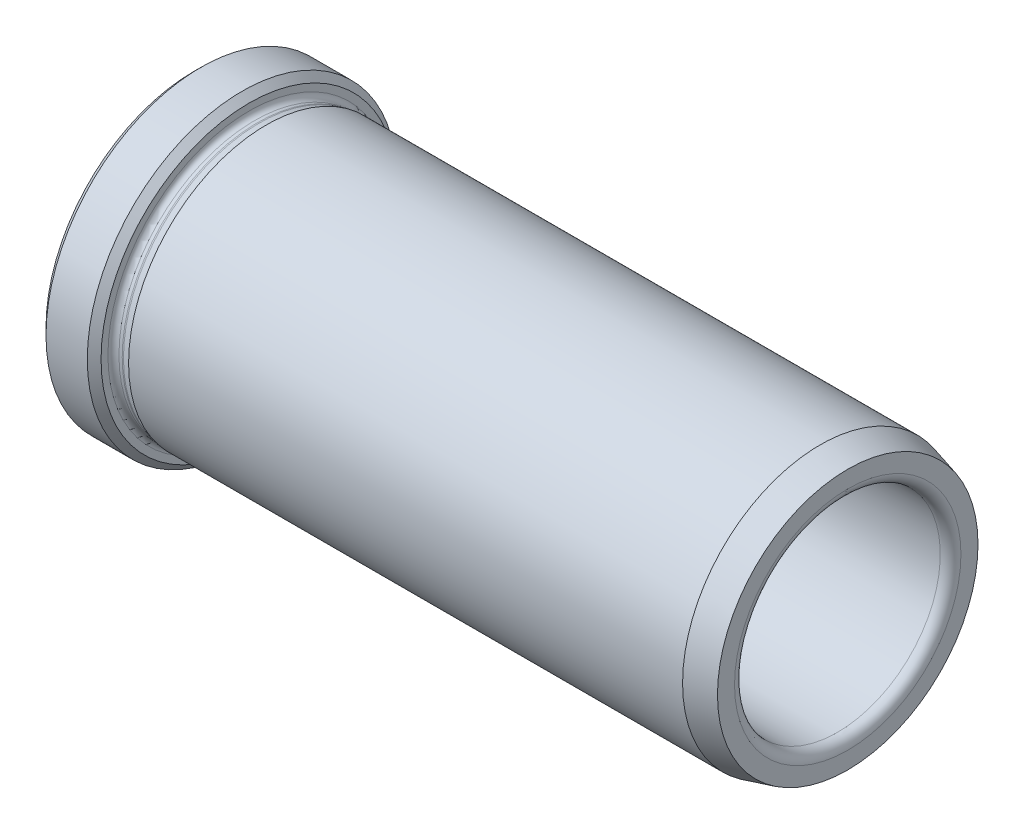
ISO-10303-21;
HEADER;
FILE_DESCRIPTION(('STEP AP214'),'2;1');
FILE_NAME('part.step','',(''),(''),'','','');
FILE_SCHEMA(('AUTOMOTIVE_DESIGN { 1 0 10303 214 1 1 1 1 }'));
ENDSEC;
DATA;
#1=APPLICATION_CONTEXT('core data for automotive mechanical design processes');
#2=APPLICATION_PROTOCOL_DEFINITION('international standard','automotive_design',2000,#1);
#3=PRODUCT_CONTEXT('',#1,'mechanical');
#4=PRODUCT('Part','Part','',(#3));
#5=PRODUCT_RELATED_PRODUCT_CATEGORY('part','',(#4));
#6=PRODUCT_DEFINITION_FORMATION('','',#4);
#7=PRODUCT_DEFINITION_CONTEXT('part definition',#1,'design');
#8=PRODUCT_DEFINITION('design','',#6,#7);
#9=PRODUCT_DEFINITION_SHAPE('','',#8);
#10=(LENGTH_UNIT() NAMED_UNIT(*) SI_UNIT(.MILLI.,.METRE.));
#11=(NAMED_UNIT(*) PLANE_ANGLE_UNIT() SI_UNIT($,.RADIAN.));
#12=(NAMED_UNIT(*) SI_UNIT($,.STERADIAN.) SOLID_ANGLE_UNIT());
#13=UNCERTAINTY_MEASURE_WITH_UNIT(LENGTH_MEASURE(1.E-05),#10,'distance_accuracy_value','');
#14=(GEOMETRIC_REPRESENTATION_CONTEXT(3) GLOBAL_UNCERTAINTY_ASSIGNED_CONTEXT((#13)) GLOBAL_UNIT_ASSIGNED_CONTEXT((#10,
#11,#12)) REPRESENTATION_CONTEXT('',''));
#15=CARTESIAN_POINT('',(0.,0.,0.));
#16=DIRECTION('',(0.,0.,1.));
#17=DIRECTION('',(1.,0.,0.));
#18=AXIS2_PLACEMENT_3D('',#15,#16,#17);
#19=CARTESIAN_POINT('',(30.9097582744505,14.95,0.));
#20=DIRECTION('',(1.,0.,0.));
#21=DIRECTION('',(0.,0.,-1.));
#22=AXIS2_PLACEMENT_3D('',#19,#20,#21);
#23=PLANE('',#22);
#24=CARTESIAN_POINT('',(30.9097582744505,0.,0.));
#25=DIRECTION('',(-1.,0.,0.));
#26=DIRECTION('',(0.,0.,1.));
#27=AXIS2_PLACEMENT_3D('',#24,#25,#26);
#28=CIRCLE('',#27,14.95);
#29=CARTESIAN_POINT('',(30.9097582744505,0.,14.95));
#30=VERTEX_POINT('',#29);
#31=EDGE_CURVE('E46',#30,#30,#28,.T.);
#32=ORIENTED_EDGE('',*,*,#31,.F.);
#33=EDGE_LOOP('',(#32));
#34=FACE_BOUND('',#33,.T.);
#35=CARTESIAN_POINT('',(30.9097582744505,0.,0.));
#36=DIRECTION('',(-1.,0.,0.));
#37=DIRECTION('',(0.,0.,1.));
#38=AXIS2_PLACEMENT_3D('',#35,#36,#37);
#39=CIRCLE('',#38,15.);
#40=CARTESIAN_POINT('',(30.9097582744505,0.,15.));
#41=VERTEX_POINT('',#40);
#42=EDGE_CURVE('E70',#41,#41,#39,.T.);
#43=ORIENTED_EDGE('',*,*,#42,.T.);
#44=EDGE_LOOP('',(#43));
#45=FACE_BOUND('',#44,.T.);
#46=ADVANCED_FACE('F14',(#34,#45),#23,.F.);
#47=CARTESIAN_POINT('',(0.,0.,0.));
#48=DIRECTION('',(-1.,0.,0.));
#49=DIRECTION('',(0.,0.,1.));
#50=AXIS2_PLACEMENT_3D('',#47,#48,#49);
#51=CYLINDRICAL_SURFACE('',#50,14.95);
#52=CARTESIAN_POINT('',(94.4097582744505,0.,0.));
#53=DIRECTION('',(-1.,0.,0.));
#54=DIRECTION('',(0.,0.,1.));
#55=AXIS2_PLACEMENT_3D('',#52,#53,#54);
#56=CIRCLE('',#55,14.95);
#57=CARTESIAN_POINT('',(94.4097582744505,0.,14.95));
#58=VERTEX_POINT('',#57);
#59=EDGE_CURVE('E34',#58,#58,#56,.F.);
#60=ORIENTED_EDGE('',*,*,#59,.T.);
#61=EDGE_LOOP('',(#60));
#62=FACE_BOUND('',#61,.T.);
#63=ORIENTED_EDGE('',*,*,#31,.T.);
#64=EDGE_LOOP('',(#63));
#65=FACE_BOUND('',#64,.T.);
#66=ADVANCED_FACE('F94',(#62,#65),#51,.F.);
#67=CARTESIAN_POINT('',(95.9097582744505,18.9282032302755,0.));
#68=DIRECTION('',(-1.,0.,0.));
#69=DIRECTION('',(0.,0.,1.));
#70=AXIS2_PLACEMENT_3D('',#67,#68,#69);
#71=PLANE('',#70);
#72=CARTESIAN_POINT('',(95.9097582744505,0.,0.));
#73=DIRECTION('',(-1.,0.,0.));
#74=DIRECTION('',(0.,0.,1.));
#75=AXIS2_PLACEMENT_3D('',#72,#73,#74);
#76=CIRCLE('',#75,16.45);
#77=CARTESIAN_POINT('',(95.9097582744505,0.,16.45));
#78=VERTEX_POINT('',#77);
#79=EDGE_CURVE('E37',#78,#78,#76,.T.);
#80=ORIENTED_EDGE('',*,*,#79,.T.);
#81=EDGE_LOOP('',(#80));
#82=FACE_BOUND('',#81,.T.);
#83=CARTESIAN_POINT('',(95.9097582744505,0.,0.));
#84=DIRECTION('',(-1.,0.,0.));
#85=DIRECTION('',(0.,0.,1.));
#86=AXIS2_PLACEMENT_3D('',#83,#84,#85);
#87=CIRCLE('',#86,18.9282032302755);
#88=CARTESIAN_POINT('',(95.9097582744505,0.,18.9282032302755));
#89=VERTEX_POINT('',#88);
#90=EDGE_CURVE('E49',#89,#89,#87,.T.);
#91=ORIENTED_EDGE('',*,*,#90,.F.);
#92=EDGE_LOOP('',(#91));
#93=FACE_BOUND('',#92,.T.);
#94=ADVANCED_FACE('F101',(#82,#93),#71,.F.);
#95=CARTESIAN_POINT('',(95.9097582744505,0.,0.));
#96=DIRECTION('',(-1.,0.,0.));
#97=DIRECTION('',(0.,0.,1.));
#98=AXIS2_PLACEMENT_3D('',#95,#96,#97);
#99=CONICAL_SURFACE('',#98,18.9282032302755,0.26179938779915);
#100=CARTESIAN_POINT('',(91.9097582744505,0.,0.));
#101=DIRECTION('',(-1.,0.,0.));
#102=DIRECTION('',(0.,0.,1.));
#103=AXIS2_PLACEMENT_3D('',#100,#101,#102);
#104=CIRCLE('',#103,20.);
#105=CARTESIAN_POINT('',(91.9097582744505,0.,20.));
#106=VERTEX_POINT('',#105);
#107=EDGE_CURVE('E52',#106,#106,#104,.T.);
#108=ORIENTED_EDGE('',*,*,#107,.F.);
#109=EDGE_LOOP('',(#108));
#110=FACE_BOUND('',#109,.T.);
#111=ORIENTED_EDGE('',*,*,#90,.T.);
#112=EDGE_LOOP('',(#111));
#113=FACE_BOUND('',#112,.T.);
#114=ADVANCED_FACE('F165',(#110,#113),#99,.T.);
#115=CARTESIAN_POINT('',(0.,0.,0.));
#116=DIRECTION('',(-1.,0.,0.));
#117=DIRECTION('',(0.,0.,1.));
#118=AXIS2_PLACEMENT_3D('',#115,#116,#117);
#119=CYLINDRICAL_SURFACE('',#118,20.);
#120=CARTESIAN_POINT('',(11.4097582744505,0.,0.));
#121=DIRECTION('',(-1.,0.,0.));
#122=DIRECTION('',(0.,0.,1.));
#123=AXIS2_PLACEMENT_3D('',#120,#121,#122);
#124=CIRCLE('',#123,20.);
#125=CARTESIAN_POINT('',(11.4097582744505,0.,20.));
#126=VERTEX_POINT('',#125);
#127=EDGE_CURVE('E55',#126,#126,#124,.T.);
#128=ORIENTED_EDGE('',*,*,#127,.F.);
#129=EDGE_LOOP('',(#128));
#130=FACE_BOUND('',#129,.T.);
#131=ORIENTED_EDGE('',*,*,#107,.T.);
#132=EDGE_LOOP('',(#131));
#133=FACE_BOUND('',#132,.T.);
#134=ADVANCED_FACE('F205',(#130,#133),#119,.T.);
#135=CARTESIAN_POINT('',(11.4097582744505,0.,0.));
#136=DIRECTION('',(1.,0.,0.));
#137=DIRECTION('',(0.,0.,-1.));
#138=AXIS2_PLACEMENT_3D('',#135,#136,#137);
#139=CONICAL_SURFACE('',#138,20.,0.26179938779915);
#140=CARTESIAN_POINT('',(10.3918762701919,0.,0.));
#141=DIRECTION('',(-1.,0.,0.));
#142=DIRECTION('',(0.,0.,1.));
#143=AXIS2_PLACEMENT_3D('',#140,#141,#142);
#144=CIRCLE('',#143,19.7272593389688);
#145=CARTESIAN_POINT('',(10.3918762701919,0.,19.7272593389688));
#146=VERTEX_POINT('',#145);
#147=EDGE_CURVE('E58',#146,#146,#144,.T.);
#148=ORIENTED_EDGE('',*,*,#147,.F.);
#149=EDGE_LOOP('',(#148));
#150=FACE_BOUND('',#149,.T.);
#151=ORIENTED_EDGE('',*,*,#127,.T.);
#152=EDGE_LOOP('',(#151));
#153=FACE_BOUND('',#152,.T.);
#154=ADVANCED_FACE('F195',(#150,#153),#139,.T.);
#155=CARTESIAN_POINT('',(10.1848210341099,0.,0.));
#156=DIRECTION('',(-1.,0.,0.));
#157=DIRECTION('',(0.,0.,1.));
#158=AXIS2_PLACEMENT_3D('',#155,#156,#157);
#159=TOROIDAL_SURFACE('',#158,20.5,0.8);
#160=CARTESIAN_POINT('',(10.1848210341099,0.,0.));
#161=DIRECTION('',(-1.,0.,0.));
#162=DIRECTION('',(0.,0.,1.));
#163=AXIS2_PLACEMENT_3D('',#160,#161,#162);
#164=CIRCLE('',#163,19.7);
#165=CARTESIAN_POINT('',(10.1848210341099,0.,19.7));
#166=VERTEX_POINT('',#165);
#167=EDGE_CURVE('E61',#166,#166,#164,.T.);
#168=ORIENTED_EDGE('',*,*,#167,.F.);
#169=EDGE_LOOP('',(#168));
#170=FACE_BOUND('',#169,.T.);
#171=ORIENTED_EDGE('',*,*,#147,.T.);
#172=EDGE_LOOP('',(#171));
#173=FACE_BOUND('',#172,.T.);
#174=ADVANCED_FACE('F185',(#170,#173),#159,.F.);
#175=CARTESIAN_POINT('',(0.,0.,0.));
#176=DIRECTION('',(-1.,0.,0.));
#177=DIRECTION('',(0.,0.,1.));
#178=AXIS2_PLACEMENT_3D('',#175,#176,#177);
#179=CYLINDRICAL_SURFACE('',#178,19.7);
#180=CARTESIAN_POINT('',(9.7097582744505,0.,0.));
#181=DIRECTION('',(-1.,0.,0.));
#182=DIRECTION('',(0.,0.,1.));
#183=AXIS2_PLACEMENT_3D('',#180,#181,#182);
#184=CIRCLE('',#183,19.7);
#185=CARTESIAN_POINT('',(9.7097582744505,0.,19.7));
#186=VERTEX_POINT('',#185);
#187=EDGE_CURVE('E64',#186,#186,#184,.T.);
#188=ORIENTED_EDGE('',*,*,#187,.F.);
#189=EDGE_LOOP('',(#188));
#190=FACE_BOUND('',#189,.T.);
#191=ORIENTED_EDGE('',*,*,#167,.T.);
#192=EDGE_LOOP('',(#191));
#193=FACE_BOUND('',#192,.T.);
#194=ADVANCED_FACE('F175',(#190,#193),#179,.T.);
#195=CARTESIAN_POINT('',(9.7097582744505,0.,0.));
#196=DIRECTION('',(-1.,0.,0.));
#197=DIRECTION('',(0.,0.,1.));
#198=AXIS2_PLACEMENT_3D('',#195,#196,#197);
#199=TOROIDAL_SURFACE('',#198,20.5,0.8);
#200=CARTESIAN_POINT('',(8.90975827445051,0.,0.));
#201=DIRECTION('',(-1.,0.,0.));
#202=DIRECTION('',(0.,0.,1.));
#203=AXIS2_PLACEMENT_3D('',#200,#201,#202);
#204=CIRCLE('',#203,20.5);
#205=CARTESIAN_POINT('',(8.90975827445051,0.,20.5));
#206=VERTEX_POINT('',#205);
#207=EDGE_CURVE('E67',#206,#206,#204,.T.);
#208=ORIENTED_EDGE('',*,*,#207,.F.);
#209=EDGE_LOOP('',(#208));
#210=FACE_BOUND('',#209,.T.);
#211=ORIENTED_EDGE('',*,*,#187,.T.);
#212=EDGE_LOOP('',(#211));
#213=FACE_BOUND('',#212,.T.);
#214=ADVANCED_FACE('F154',(#210,#213),#199,.F.);
#215=CARTESIAN_POINT('',(8.9097582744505,22.5,0.));
#216=DIRECTION('',(-1.,0.,0.));
#217=DIRECTION('',(0.,0.,1.));
#218=AXIS2_PLACEMENT_3D('',#215,#216,#217);
#219=PLANE('',#218);
#220=CARTESIAN_POINT('',(8.9097582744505,0.,0.));
#221=DIRECTION('',(-1.,0.,0.));
#222=DIRECTION('',(0.,0.,1.));
#223=AXIS2_PLACEMENT_3D('',#220,#221,#222);
#224=CIRCLE('',#223,21.5);
#225=CARTESIAN_POINT('',(8.9097582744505,0.,21.5));
#226=VERTEX_POINT('',#225);
#227=EDGE_CURVE('E9',#226,#226,#224,.F.);
#228=ORIENTED_EDGE('',*,*,#227,.T.);
#229=EDGE_LOOP('',(#228));
#230=FACE_BOUND('',#229,.T.);
#231=ORIENTED_EDGE('',*,*,#207,.T.);
#232=EDGE_LOOP('',(#231));
#233=FACE_BOUND('',#232,.T.);
#234=ADVANCED_FACE('F144',(#230,#233),#219,.F.);
#235=CARTESIAN_POINT('',(0.,0.,0.));
#236=DIRECTION('',(-1.,0.,0.));
#237=DIRECTION('',(0.,0.,1.));
#238=AXIS2_PLACEMENT_3D('',#235,#236,#237);
#239=CYLINDRICAL_SURFACE('',#238,22.5);
#240=CARTESIAN_POINT('',(7.90975827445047,0.,0.));
#241=DIRECTION('',(-1.,0.,0.));
#242=DIRECTION('',(0.,0.,1.));
#243=AXIS2_PLACEMENT_3D('',#240,#241,#242);
#244=CIRCLE('',#243,22.5);
#245=CARTESIAN_POINT('',(7.90975827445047,0.,22.5));
#246=VERTEX_POINT('',#245);
#247=EDGE_CURVE('E21',#246,#246,#244,.T.);
#248=ORIENTED_EDGE('',*,*,#247,.T.);
#249=EDGE_LOOP('',(#248));
#250=FACE_BOUND('',#249,.T.);
#251=CARTESIAN_POINT('',(1.90975827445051,0.,0.));
#252=DIRECTION('',(1.,0.,0.));
#253=DIRECTION('',(0.,0.,-1.));
#254=AXIS2_PLACEMENT_3D('',#251,#252,#253);
#255=CIRCLE('',#254,22.5);
#256=CARTESIAN_POINT('',(1.90975827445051,0.,-22.5));
#257=VERTEX_POINT('',#256);
#258=EDGE_CURVE('E40',#257,#257,#255,.T.);
#259=ORIENTED_EDGE('',*,*,#258,.T.);
#260=EDGE_LOOP('',(#259));
#261=FACE_BOUND('',#260,.T.);
#262=ADVANCED_FACE('F90',(#250,#261),#239,.T.);
#263=CARTESIAN_POINT('',(0.909758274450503,22.5,0.));
#264=DIRECTION('',(1.,0.,0.));
#265=DIRECTION('',(0.,0.,-1.));
#266=AXIS2_PLACEMENT_3D('',#263,#264,#265);
#267=PLANE('',#266);
#268=CARTESIAN_POINT('',(0.909758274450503,0.,0.));
#269=DIRECTION('',(1.,0.,0.));
#270=DIRECTION('',(0.,0.,-1.));
#271=AXIS2_PLACEMENT_3D('',#268,#269,#270);
#272=CIRCLE('',#271,16.5);
#273=CARTESIAN_POINT('',(0.909758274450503,0.,-16.5));
#274=VERTEX_POINT('',#273);
#275=EDGE_CURVE('E25',#274,#274,#272,.T.);
#276=ORIENTED_EDGE('',*,*,#275,.T.);
#277=EDGE_LOOP('',(#276));
#278=FACE_BOUND('',#277,.T.);
#279=CARTESIAN_POINT('',(0.909758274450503,0.,0.));
#280=DIRECTION('',(1.,0.,0.));
#281=DIRECTION('',(0.,0.,-1.));
#282=AXIS2_PLACEMENT_3D('',#279,#280,#281);
#283=CIRCLE('',#282,21.5);
#284=CARTESIAN_POINT('',(0.909758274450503,0.,-21.5));
#285=VERTEX_POINT('',#284);
#286=EDGE_CURVE('E43',#285,#285,#283,.F.);
#287=ORIENTED_EDGE('',*,*,#286,.T.);
#288=EDGE_LOOP('',(#287));
#289=FACE_BOUND('',#288,.T.);
#290=ADVANCED_FACE('F78',(#278,#289),#267,.F.);
#291=CARTESIAN_POINT('',(0.,0.,0.));
#292=DIRECTION('',(-1.,0.,0.));
#293=DIRECTION('',(0.,0.,1.));
#294=AXIS2_PLACEMENT_3D('',#291,#292,#293);
#295=CYLINDRICAL_SURFACE('',#294,15.);
#296=CARTESIAN_POINT('',(2.40975827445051,0.,0.));
#297=DIRECTION('',(1.,0.,0.));
#298=DIRECTION('',(0.,0.,-1.));
#299=AXIS2_PLACEMENT_3D('',#296,#297,#298);
#300=CIRCLE('',#299,15.);
#301=CARTESIAN_POINT('',(2.40975827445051,0.,-15.));
#302=VERTEX_POINT('',#301);
#303=EDGE_CURVE('E29',#302,#302,#300,.F.);
#304=ORIENTED_EDGE('',*,*,#303,.T.);
#305=EDGE_LOOP('',(#304));
#306=FACE_BOUND('',#305,.T.);
#307=ORIENTED_EDGE('',*,*,#42,.F.);
#308=EDGE_LOOP('',(#307));
#309=FACE_BOUND('',#308,.T.);
#310=ADVANCED_FACE('F75',(#306,#309),#295,.F.);
#311=CARTESIAN_POINT('',(0.909758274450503,0.,0.));
#312=DIRECTION('',(1.,0.,0.));
#313=DIRECTION('',(0.,0.,-1.));
#314=AXIS2_PLACEMENT_3D('',#311,#312,#313);
#315=CONICAL_SURFACE('',#314,21.5,0.785398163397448);
#316=ORIENTED_EDGE('',*,*,#258,.F.);
#317=EDGE_LOOP('',(#316));
#318=FACE_BOUND('',#317,.T.);
#319=ORIENTED_EDGE('',*,*,#286,.F.);
#320=EDGE_LOOP('',(#319));
#321=FACE_BOUND('',#320,.T.);
#322=ADVANCED_FACE('F77',(#318,#321),#315,.T.);
#323=CARTESIAN_POINT('',(94.4097582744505,0.,0.));
#324=DIRECTION('',(-1.,0.,0.));
#325=DIRECTION('',(0.,0.,1.));
#326=AXIS2_PLACEMENT_3D('',#323,#324,#325);
#327=TOROIDAL_SURFACE('',#326,16.45,1.5);
#328=ORIENTED_EDGE('',*,*,#59,.F.);
#329=EDGE_LOOP('',(#328));
#330=FACE_BOUND('',#329,.T.);
#331=ORIENTED_EDGE('',*,*,#79,.F.);
#332=EDGE_LOOP('',(#331));
#333=FACE_BOUND('',#332,.T.);
#334=ADVANCED_FACE('F87',(#330,#333),#327,.T.);
#335=CARTESIAN_POINT('',(2.40975827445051,0.,0.));
#336=DIRECTION('',(1.,0.,0.));
#337=DIRECTION('',(0.,0.,-1.));
#338=AXIS2_PLACEMENT_3D('',#335,#336,#337);
#339=TOROIDAL_SURFACE('',#338,16.5,1.5);
#340=ORIENTED_EDGE('',*,*,#275,.F.);
#341=EDGE_LOOP('',(#340));
#342=FACE_BOUND('',#341,.T.);
#343=ORIENTED_EDGE('',*,*,#303,.F.);
#344=EDGE_LOOP('',(#343));
#345=FACE_BOUND('',#344,.T.);
#346=ADVANCED_FACE('F108',(#342,#345),#339,.T.);
#347=CARTESIAN_POINT('',(7.90975827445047,0.,0.));
#348=DIRECTION('',(-1.,0.,0.));
#349=DIRECTION('',(0.,0.,1.));
#350=AXIS2_PLACEMENT_3D('',#347,#348,#349);
#351=CONICAL_SURFACE('',#350,22.5,0.78539816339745);
#352=ORIENTED_EDGE('',*,*,#227,.F.);
#353=EDGE_LOOP('',(#352));
#354=FACE_BOUND('',#353,.T.);
#355=ORIENTED_EDGE('',*,*,#247,.F.);
#356=EDGE_LOOP('',(#355));
#357=FACE_BOUND('',#356,.T.);
#358=ADVANCED_FACE('F16',(#354,#357),#351,.T.);
#359=CLOSED_SHELL('',(#46,#66,#94,#114,#134,#154,#174,#194,#214,#234,#262,#290,#310,#322,#334,
#346,#358));
#360=MANIFOLD_SOLID_BREP('B1',#359);
#361=ADVANCED_BREP_SHAPE_REPRESENTATION('',(#18,#360),#14);
#362=SHAPE_DEFINITION_REPRESENTATION(#9,#361);
ENDSEC;
END-ISO-10303-21;
